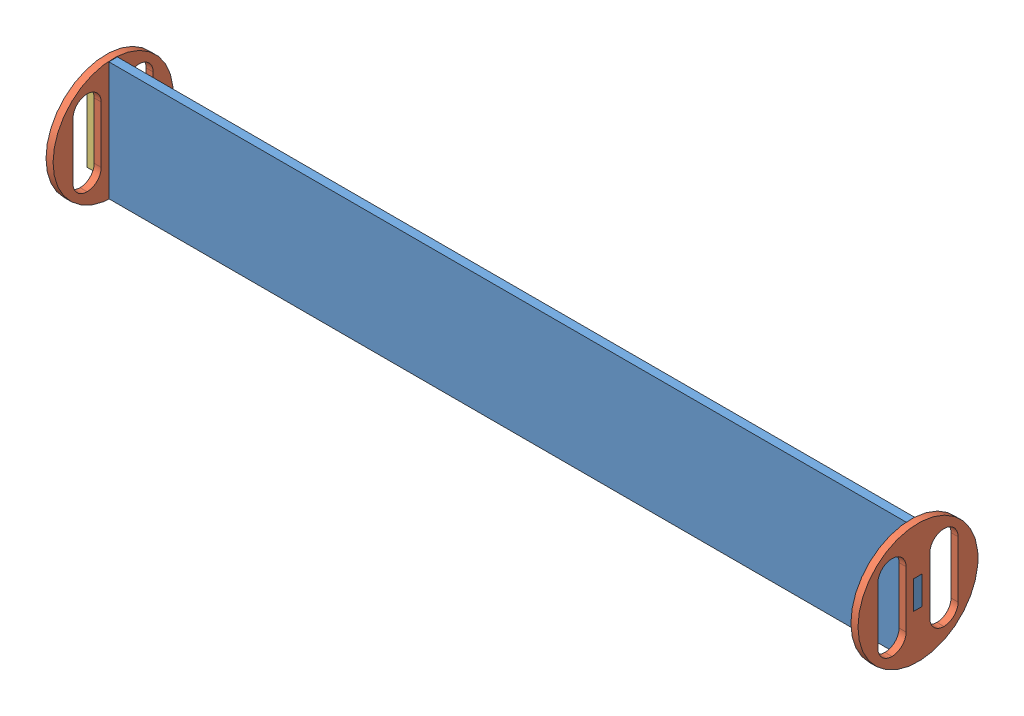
SolidWorks assembly NewAvionicsBay.SLDASM, configuration Default (file format 3100). Lengths in mm.
Overall size (368.3 53.98 53.98).
4 component instances, 3 part files, 8 mates.
Components (placement in the parent):
- AvionicsMainBoard-1: AvionicsMainBoard.SLDPRT [Default] at (-38.8076 31.0486 -14.0068) size (365.13 53.34 3.81)
- AvionicsAftDisk-2: AvionicsAftDisk.SLDPRT [Default] at (-152.2163 37.3986 -12.1018) x (0 0 -1) z (1 0 0) size (53.98 53.98 3.17)
- AvionicsAftDisk-1: AvionicsAftDisk.SLDPRT [Default] at (209.7337 37.3986 -12.1018) x (0 0 -1) z (1 0 0) size (53.98 53.98 3.17)
- Avionics Slot Insertion-1: Avionics Slot Insertion.SLDPRT [Default] at (-155.3913 21.5236 -17.4358) x (0 1 0) z (1 0 0) size (31.75 10.67 3.17)
Mates (geometry in assembly coordinates):
- Coincident1: coincident anti-aligned: plane of AvionicsMainBoard-1 through (209.7337 64.0686 -10.1968) normal (0 0 1); plane of AvionicsAftDisk-2 through (-149.0413 43.7486 -10.1968) normal (0 0 -1)
- Coincident4: coincident anti-aligned: plane of AvionicsMainBoard-1 through (-152.2163 31.0486 -10.1968) normal (0 -1 0); plane of AvionicsAftDisk-2 through (-149.0413 31.0486 -10.1968) normal (0 1 0)
- Coincident5: coincident anti-aligned: plane of AvionicsMainBoard-1 through (-149.0413 43.7486 -10.1968) normal (-1 0 0); plane of AvionicsAftDisk-2 through (-149.0413 37.3986 -12.1018) normal (1 0 0)
- Coincident6: coincident anti-aligned: plane of AvionicsMainBoard-1 through (209.7337 64.0686 -10.1968) normal (0 0 1); plane of AvionicsAftDisk-1 through (212.9087 43.7486 -10.1968) normal (0 0 -1)
- Coincident7: coincident anti-aligned: plane of AvionicsMainBoard-1 through (209.7337 31.0486 -10.1968) normal (0 -1 0); plane of AvionicsAftDisk-1 through (212.9087 31.0486 -10.1968) normal (0 1 0)
- Coincident8: coincident anti-aligned: plane of AvionicsMainBoard-1 through (209.7337 31.0486 -10.1968) normal (1 0 0); plane of AvionicsAftDisk-1 through (209.7337 37.3986 -12.1018) normal (-1 0 0)
- Coincident9: coincident anti-aligned: plane of AvionicsAftDisk-2 through (-152.2163 37.3986 -12.1018) normal (-1 0 0); plane of Avionics Slot Insertion-1 through (-152.2163 21.5236 -6.7678) normal (1 0 0)
- Distance1: distance = 9.525 mm: line of AvionicsMainBoard-1; line of Avionics Slot Insertion-1
